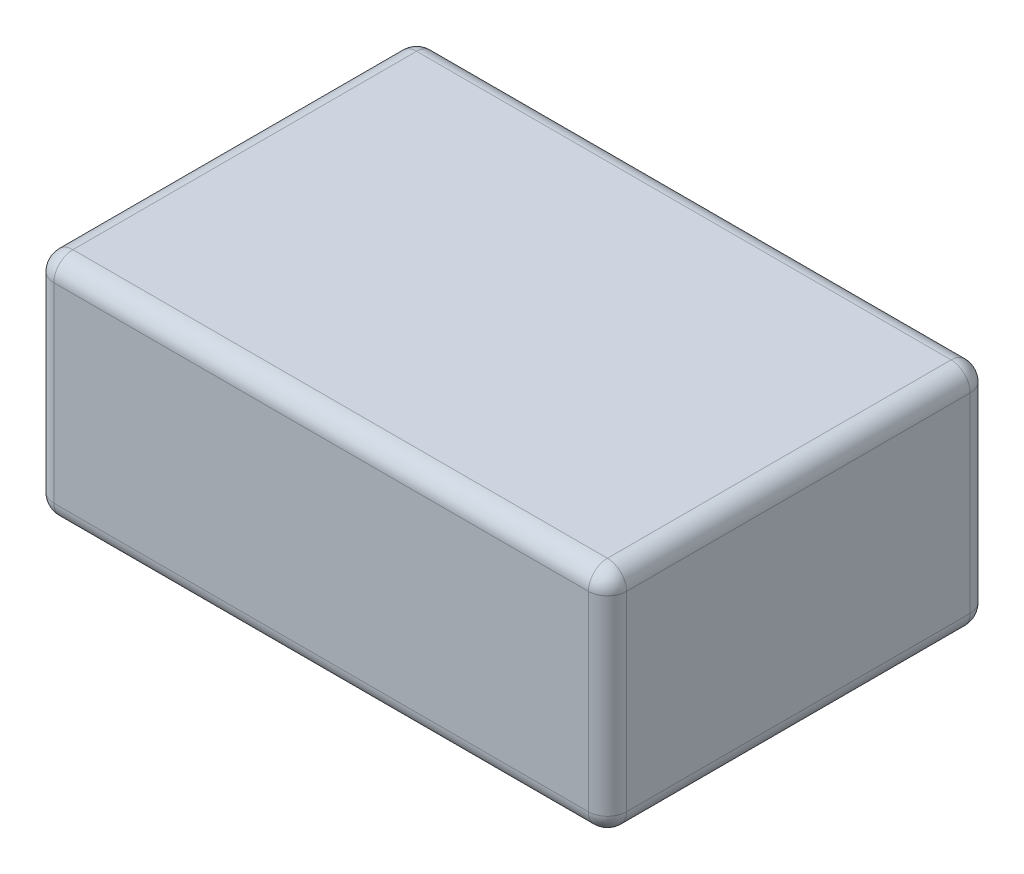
ISO-10303-21;
HEADER;
FILE_DESCRIPTION(('STEP AP214'),'2;1');
FILE_NAME('part.step','',(''),(''),'','','');
FILE_SCHEMA(('AUTOMOTIVE_DESIGN { 1 0 10303 214 1 1 1 1 }'));
ENDSEC;
DATA;
#1=APPLICATION_CONTEXT('core data for automotive mechanical design processes');
#2=APPLICATION_PROTOCOL_DEFINITION('international standard','automotive_design',2000,#1);
#3=PRODUCT_CONTEXT('',#1,'mechanical');
#4=PRODUCT('Part','Part','',(#3));
#5=PRODUCT_RELATED_PRODUCT_CATEGORY('part','',(#4));
#6=PRODUCT_DEFINITION_FORMATION('','',#4);
#7=PRODUCT_DEFINITION_CONTEXT('part definition',#1,'design');
#8=PRODUCT_DEFINITION('design','',#6,#7);
#9=PRODUCT_DEFINITION_SHAPE('','',#8);
#10=(LENGTH_UNIT() NAMED_UNIT(*) SI_UNIT(.MILLI.,.METRE.));
#11=(NAMED_UNIT(*) PLANE_ANGLE_UNIT() SI_UNIT($,.RADIAN.));
#12=(NAMED_UNIT(*) SI_UNIT($,.STERADIAN.) SOLID_ANGLE_UNIT());
#13=UNCERTAINTY_MEASURE_WITH_UNIT(LENGTH_MEASURE(1.E-05),#10,'distance_accuracy_value','');
#14=(GEOMETRIC_REPRESENTATION_CONTEXT(3) GLOBAL_UNCERTAINTY_ASSIGNED_CONTEXT((#13)) GLOBAL_UNIT_ASSIGNED_CONTEXT((#10,
#11,#12)) REPRESENTATION_CONTEXT('',''));
#15=CARTESIAN_POINT('',(0.,0.,0.));
#16=DIRECTION('',(0.,0.,1.));
#17=DIRECTION('',(1.,0.,0.));
#18=AXIS2_PLACEMENT_3D('',#15,#16,#17);
#19=CARTESIAN_POINT('',(75.,60.,-50.));
#20=DIRECTION('',(-1.,0.,0.));
#21=DIRECTION('',(0.,0.,1.));
#22=AXIS2_PLACEMENT_3D('',#19,#20,#21);
#23=PLANE('',#22);
#24=DIRECTION('',(0.,-1.,0.));
#25=VECTOR('',#24,1.);
#26=CARTESIAN_POINT('',(75.,60.,45.));
#27=LINE('',#26,#25);
#28=CARTESIAN_POINT('',(75.,55.,45.));
#29=VERTEX_POINT('',#28);
#30=CARTESIAN_POINT('',(75.,5.,45.));
#31=VERTEX_POINT('',#30);
#32=EDGE_CURVE('E151',#29,#31,#27,.T.);
#33=ORIENTED_EDGE('',*,*,#32,.T.);
#34=DIRECTION('',(0.,0.,-1.));
#35=VECTOR('',#34,1.);
#36=CARTESIAN_POINT('',(75.,5.,-50.));
#37=LINE('',#36,#35);
#38=CARTESIAN_POINT('',(75.,5.,-45.));
#39=VERTEX_POINT('',#38);
#40=EDGE_CURVE('E274',#31,#39,#37,.T.);
#41=ORIENTED_EDGE('',*,*,#40,.T.);
#42=DIRECTION('',(0.,-1.,0.));
#43=VECTOR('',#42,1.);
#44=CARTESIAN_POINT('',(75.,60.,-45.));
#45=LINE('',#44,#43);
#46=CARTESIAN_POINT('',(75.,55.,-45.));
#47=VERTEX_POINT('',#46);
#48=EDGE_CURVE('E272',#39,#47,#45,.F.);
#49=ORIENTED_EDGE('',*,*,#48,.T.);
#50=DIRECTION('',(0.,0.,-1.));
#51=VECTOR('',#50,1.);
#52=CARTESIAN_POINT('',(75.,55.,50.));
#53=LINE('',#52,#51);
#54=EDGE_CURVE('E265',#47,#29,#53,.F.);
#55=ORIENTED_EDGE('',*,*,#54,.T.);
#56=EDGE_LOOP('',(#33,#41,#49,#55));
#57=FACE_BOUND('',#56,.T.);
#58=ADVANCED_FACE('F32',(#57),#23,.F.);
#59=CARTESIAN_POINT('',(-75.,60.,-50.));
#60=DIRECTION('',(0.,0.,1.));
#61=DIRECTION('',(1.,0.,0.));
#62=AXIS2_PLACEMENT_3D('',#59,#60,#61);
#63=PLANE('',#62);
#64=DIRECTION('',(0.,-1.,0.));
#65=VECTOR('',#64,1.);
#66=CARTESIAN_POINT('',(70.,60.,-50.));
#67=LINE('',#66,#65);
#68=CARTESIAN_POINT('',(70.,55.,-50.));
#69=VERTEX_POINT('',#68);
#70=CARTESIAN_POINT('',(70.,5.,-50.));
#71=VERTEX_POINT('',#70);
#72=EDGE_CURVE('E279',#69,#71,#67,.T.);
#73=ORIENTED_EDGE('',*,*,#72,.T.);
#74=DIRECTION('',(-1.,0.,0.));
#75=VECTOR('',#74,1.);
#76=CARTESIAN_POINT('',(-75.,5.,-50.));
#77=LINE('',#76,#75);
#78=CARTESIAN_POINT('',(-70.,5.,-50.));
#79=VERTEX_POINT('',#78);
#80=EDGE_CURVE('E282',#71,#79,#77,.T.);
#81=ORIENTED_EDGE('',*,*,#80,.T.);
#82=DIRECTION('',(0.,-1.,0.));
#83=VECTOR('',#82,1.);
#84=CARTESIAN_POINT('',(-70.,60.,-50.));
#85=LINE('',#84,#83);
#86=CARTESIAN_POINT('',(-70.,55.,-50.));
#87=VERTEX_POINT('',#86);
#88=EDGE_CURVE('E210',#79,#87,#85,.F.);
#89=ORIENTED_EDGE('',*,*,#88,.T.);
#90=DIRECTION('',(-1.,0.,0.));
#91=VECTOR('',#90,1.);
#92=CARTESIAN_POINT('',(75.,55.,-50.));
#93=LINE('',#92,#91);
#94=EDGE_CURVE('E277',#87,#69,#93,.F.);
#95=ORIENTED_EDGE('',*,*,#94,.T.);
#96=EDGE_LOOP('',(#73,#81,#89,#95));
#97=FACE_BOUND('',#96,.T.);
#98=ADVANCED_FACE('F300',(#97),#63,.F.);
#99=CARTESIAN_POINT('',(-75.,60.,-50.));
#100=DIRECTION('',(1.,0.,0.));
#101=DIRECTION('',(0.,0.,-1.));
#102=AXIS2_PLACEMENT_3D('',#99,#100,#101);
#103=PLANE('',#102);
#104=CARTESIAN_POINT('',(-75.,42.5,-12.5));
#105=DIRECTION('',(-1.,0.,0.));
#106=DIRECTION('',(0.,0.,1.));
#107=AXIS2_PLACEMENT_3D('',#104,#105,#106);
#108=CIRCLE('',#107,3.);
#109=CARTESIAN_POINT('',(-75.,42.5,-9.50000000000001));
#110=VERTEX_POINT('',#109);
#111=EDGE_CURVE('E731',#110,#110,#108,.T.);
#112=ORIENTED_EDGE('',*,*,#111,.F.);
#113=EDGE_LOOP('',(#112));
#114=FACE_BOUND('',#113,.T.);
#115=CARTESIAN_POINT('',(-75.,42.5,12.5));
#116=DIRECTION('',(-1.,0.,0.));
#117=DIRECTION('',(0.,0.,1.));
#118=AXIS2_PLACEMENT_3D('',#115,#116,#117);
#119=CIRCLE('',#118,3.);
#120=CARTESIAN_POINT('',(-75.,42.5,15.5));
#121=VERTEX_POINT('',#120);
#122=EDGE_CURVE('E735',#121,#121,#119,.T.);
#123=ORIENTED_EDGE('',*,*,#122,.F.);
#124=EDGE_LOOP('',(#123));
#125=FACE_BOUND('',#124,.T.);
#126=CARTESIAN_POINT('',(-75.,42.5,37.5));
#127=DIRECTION('',(-1.,0.,0.));
#128=DIRECTION('',(0.,0.,1.));
#129=AXIS2_PLACEMENT_3D('',#126,#127,#128);
#130=CIRCLE('',#129,2.);
#131=CARTESIAN_POINT('',(-75.,42.5,39.5));
#132=VERTEX_POINT('',#131);
#133=EDGE_CURVE('E739',#132,#132,#130,.T.);
#134=ORIENTED_EDGE('',*,*,#133,.F.);
#135=EDGE_LOOP('',(#134));
#136=FACE_BOUND('',#135,.T.);
#137=CARTESIAN_POINT('',(-75.,17.5,37.5));
#138=DIRECTION('',(-1.,0.,0.));
#139=DIRECTION('',(0.,0.,1.));
#140=AXIS2_PLACEMENT_3D('',#137,#138,#139);
#141=CIRCLE('',#140,3.);
#142=CARTESIAN_POINT('',(-75.,17.5,40.5));
#143=VERTEX_POINT('',#142);
#144=EDGE_CURVE('E743',#143,#143,#141,.T.);
#145=ORIENTED_EDGE('',*,*,#144,.F.);
#146=EDGE_LOOP('',(#145));
#147=FACE_BOUND('',#146,.T.);
#148=CARTESIAN_POINT('',(-75.,17.5,-12.5));
#149=DIRECTION('',(-1.,0.,0.));
#150=DIRECTION('',(0.,0.,1.));
#151=AXIS2_PLACEMENT_3D('',#148,#149,#150);
#152=CIRCLE('',#151,3.);
#153=CARTESIAN_POINT('',(-75.,17.5,-9.50000000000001));
#154=VERTEX_POINT('',#153);
#155=EDGE_CURVE('E747',#154,#154,#152,.T.);
#156=ORIENTED_EDGE('',*,*,#155,.F.);
#157=EDGE_LOOP('',(#156));
#158=FACE_BOUND('',#157,.T.);
#159=CARTESIAN_POINT('',(-75.,17.5,-37.5));
#160=DIRECTION('',(-1.,0.,0.));
#161=DIRECTION('',(0.,0.,1.));
#162=AXIS2_PLACEMENT_3D('',#159,#160,#161);
#163=CIRCLE('',#162,3.);
#164=CARTESIAN_POINT('',(-75.,17.5,-34.5));
#165=VERTEX_POINT('',#164);
#166=EDGE_CURVE('E751',#165,#165,#163,.T.);
#167=ORIENTED_EDGE('',*,*,#166,.F.);
#168=EDGE_LOOP('',(#167));
#169=FACE_BOUND('',#168,.T.);
#170=CARTESIAN_POINT('',(-75.,17.5,12.5));
#171=DIRECTION('',(-1.,0.,0.));
#172=DIRECTION('',(0.,0.,1.));
#173=AXIS2_PLACEMENT_3D('',#170,#171,#172);
#174=CIRCLE('',#173,3.);
#175=CARTESIAN_POINT('',(-75.,17.5,15.5));
#176=VERTEX_POINT('',#175);
#177=EDGE_CURVE('E755',#176,#176,#174,.T.);
#178=ORIENTED_EDGE('',*,*,#177,.F.);
#179=EDGE_LOOP('',(#178));
#180=FACE_BOUND('',#179,.T.);
#181=CARTESIAN_POINT('',(-75.,42.5,-37.5));
#182=DIRECTION('',(-1.,0.,0.));
#183=DIRECTION('',(0.,0.,1.));
#184=AXIS2_PLACEMENT_3D('',#181,#182,#183);
#185=CIRCLE('',#184,3.);
#186=CARTESIAN_POINT('',(-75.,42.5,-34.5));
#187=VERTEX_POINT('',#186);
#188=EDGE_CURVE('E758',#187,#187,#185,.T.);
#189=ORIENTED_EDGE('',*,*,#188,.F.);
#190=EDGE_LOOP('',(#189));
#191=FACE_BOUND('',#190,.T.);
#192=DIRECTION('',(0.,-1.,0.));
#193=VECTOR('',#192,1.);
#194=CARTESIAN_POINT('',(-75.,60.,-45.));
#195=LINE('',#194,#193);
#196=CARTESIAN_POINT('',(-75.,55.,-45.));
#197=VERTEX_POINT('',#196);
#198=CARTESIAN_POINT('',(-75.,5.,-45.));
#199=VERTEX_POINT('',#198);
#200=EDGE_CURVE('E212',#197,#199,#195,.T.);
#201=ORIENTED_EDGE('',*,*,#200,.T.);
#202=DIRECTION('',(0.,0.,1.));
#203=VECTOR('',#202,1.);
#204=CARTESIAN_POINT('',(-75.,5.,-50.));
#205=LINE('',#204,#203);
#206=CARTESIAN_POINT('',(-75.,5.,45.));
#207=VERTEX_POINT('',#206);
#208=EDGE_CURVE('E216',#199,#207,#205,.T.);
#209=ORIENTED_EDGE('',*,*,#208,.T.);
#210=DIRECTION('',(0.,-1.,0.));
#211=VECTOR('',#210,1.);
#212=CARTESIAN_POINT('',(-75.,60.,45.));
#213=LINE('',#212,#211);
#214=CARTESIAN_POINT('',(-75.,55.,45.));
#215=VERTEX_POINT('',#214);
#216=EDGE_CURVE('E217',#207,#215,#213,.F.);
#217=ORIENTED_EDGE('',*,*,#216,.T.);
#218=DIRECTION('',(0.,0.,1.));
#219=VECTOR('',#218,1.);
#220=CARTESIAN_POINT('',(-75.,55.,-50.));
#221=LINE('',#220,#219);
#222=EDGE_CURVE('E221',#215,#197,#221,.F.);
#223=ORIENTED_EDGE('',*,*,#222,.T.);
#224=EDGE_LOOP('',(#201,#209,#217,#223));
#225=FACE_BOUND('',#224,.T.);
#226=ADVANCED_FACE('F284',(#114,#125,#136,#147,#158,#169,#180,#191,#225),#103,.F.);
#227=CARTESIAN_POINT('',(-75.,60.,50.));
#228=DIRECTION('',(0.,0.,-1.));
#229=DIRECTION('',(-1.,0.,0.));
#230=AXIS2_PLACEMENT_3D('',#227,#228,#229);
#231=PLANE('',#230);
#232=DIRECTION('',(0.,-1.,0.));
#233=VECTOR('',#232,1.);
#234=CARTESIAN_POINT('',(-70.,60.,50.));
#235=LINE('',#234,#233);
#236=CARTESIAN_POINT('',(-70.,55.,50.));
#237=VERTEX_POINT('',#236);
#238=CARTESIAN_POINT('',(-70.,5.,50.));
#239=VERTEX_POINT('',#238);
#240=EDGE_CURVE('E130',#237,#239,#235,.T.);
#241=ORIENTED_EDGE('',*,*,#240,.T.);
#242=DIRECTION('',(1.,0.,0.));
#243=VECTOR('',#242,1.);
#244=CARTESIAN_POINT('',(-75.,5.,50.));
#245=LINE('',#244,#243);
#246=CARTESIAN_POINT('',(70.,5.,50.));
#247=VERTEX_POINT('',#246);
#248=EDGE_CURVE('E126',#239,#247,#245,.T.);
#249=ORIENTED_EDGE('',*,*,#248,.T.);
#250=DIRECTION('',(0.,-1.,0.));
#251=VECTOR('',#250,1.);
#252=CARTESIAN_POINT('',(70.,60.,50.));
#253=LINE('',#252,#251);
#254=CARTESIAN_POINT('',(70.,55.,50.));
#255=VERTEX_POINT('',#254);
#256=EDGE_CURVE('E120',#247,#255,#253,.F.);
#257=ORIENTED_EDGE('',*,*,#256,.T.);
#258=DIRECTION('',(1.,0.,0.));
#259=VECTOR('',#258,1.);
#260=CARTESIAN_POINT('',(-75.,55.,50.));
#261=LINE('',#260,#259);
#262=EDGE_CURVE('E123',#255,#237,#261,.F.);
#263=ORIENTED_EDGE('',*,*,#262,.T.);
#264=EDGE_LOOP('',(#241,#249,#257,#263));
#265=FACE_BOUND('',#264,.T.);
#266=ADVANCED_FACE('F122',(#265),#231,.F.);
#267=CARTESIAN_POINT('',(0.,60.,0.));
#268=DIRECTION('',(0.,1.,0.));
#269=DIRECTION('',(0.,0.,1.));
#270=AXIS2_PLACEMENT_3D('',#267,#268,#269);
#271=PLANE('',#270);
#272=DIRECTION('',(0.,0.,-1.));
#273=VECTOR('',#272,1.);
#274=CARTESIAN_POINT('',(70.,60.,-50.));
#275=LINE('',#274,#273);
#276=CARTESIAN_POINT('',(70.,60.,45.));
#277=VERTEX_POINT('',#276);
#278=CARTESIAN_POINT('',(70.,60.,-45.));
#279=VERTEX_POINT('',#278);
#280=EDGE_CURVE('E52',#277,#279,#275,.T.);
#281=ORIENTED_EDGE('',*,*,#280,.T.);
#282=DIRECTION('',(-1.,0.,0.));
#283=VECTOR('',#282,1.);
#284=CARTESIAN_POINT('',(-75.,60.,-45.));
#285=LINE('',#284,#283);
#286=CARTESIAN_POINT('',(-70.,60.,-45.));
#287=VERTEX_POINT('',#286);
#288=EDGE_CURVE('E11',#279,#287,#285,.T.);
#289=ORIENTED_EDGE('',*,*,#288,.T.);
#290=DIRECTION('',(0.,0.,1.));
#291=VECTOR('',#290,1.);
#292=CARTESIAN_POINT('',(-70.,60.,50.));
#293=LINE('',#292,#291);
#294=CARTESIAN_POINT('',(-70.,60.,45.));
#295=VERTEX_POINT('',#294);
#296=EDGE_CURVE('E41',#287,#295,#293,.T.);
#297=ORIENTED_EDGE('',*,*,#296,.T.);
#298=DIRECTION('',(1.,0.,0.));
#299=VECTOR('',#298,1.);
#300=CARTESIAN_POINT('',(75.,60.,45.));
#301=LINE('',#300,#299);
#302=EDGE_CURVE('E219',#295,#277,#301,.T.);
#303=ORIENTED_EDGE('',*,*,#302,.T.);
#304=EDGE_LOOP('',(#281,#289,#297,#303));
#305=FACE_BOUND('',#304,.T.);
#306=ADVANCED_FACE('F288',(#305),#271,.T.);
#307=CARTESIAN_POINT('',(0.,0.,0.));
#308=DIRECTION('',(0.,1.,0.));
#309=DIRECTION('',(0.,0.,1.));
#310=AXIS2_PLACEMENT_3D('',#307,#308,#309);
#311=PLANE('',#310);
#312=CARTESIAN_POINT('',(-25.,0.,0.));
#313=DIRECTION('',(0.,-1.,0.));
#314=DIRECTION('',(0.,0.,-1.));
#315=AXIS2_PLACEMENT_3D('',#312,#313,#314);
#316=CIRCLE('',#315,3.);
#317=CARTESIAN_POINT('',(-25.,0.,-3.));
#318=VERTEX_POINT('',#317);
#319=EDGE_CURVE('E772',#318,#318,#316,.T.);
#320=ORIENTED_EDGE('',*,*,#319,.F.);
#321=EDGE_LOOP('',(#320));
#322=FACE_BOUND('',#321,.T.);
#323=CARTESIAN_POINT('',(25.,0.,0.));
#324=DIRECTION('',(0.,-1.,0.));
#325=DIRECTION('',(0.,0.,-1.));
#326=AXIS2_PLACEMENT_3D('',#323,#324,#325);
#327=CIRCLE('',#326,3.);
#328=CARTESIAN_POINT('',(25.,0.,-3.));
#329=VERTEX_POINT('',#328);
#330=EDGE_CURVE('E764',#329,#329,#327,.T.);
#331=ORIENTED_EDGE('',*,*,#330,.F.);
#332=EDGE_LOOP('',(#331));
#333=FACE_BOUND('',#332,.T.);
#334=DIRECTION('',(0.,0.,-1.));
#335=VECTOR('',#334,1.);
#336=CARTESIAN_POINT('',(70.,0.,0.));
#337=LINE('',#336,#335);
#338=CARTESIAN_POINT('',(70.,0.,-45.));
#339=VERTEX_POINT('',#338);
#340=CARTESIAN_POINT('',(70.,0.,45.));
#341=VERTEX_POINT('',#340);
#342=EDGE_CURVE('E261',#339,#341,#337,.F.);
#343=ORIENTED_EDGE('',*,*,#342,.T.);
#344=DIRECTION('',(1.,0.,0.));
#345=VECTOR('',#344,1.);
#346=CARTESIAN_POINT('',(0.,0.,45.));
#347=LINE('',#346,#345);
#348=CARTESIAN_POINT('',(-70.,0.,45.));
#349=VERTEX_POINT('',#348);
#350=EDGE_CURVE('E258',#341,#349,#347,.F.);
#351=ORIENTED_EDGE('',*,*,#350,.T.);
#352=DIRECTION('',(0.,0.,1.));
#353=VECTOR('',#352,1.);
#354=CARTESIAN_POINT('',(-70.,0.,0.));
#355=LINE('',#354,#353);
#356=CARTESIAN_POINT('',(-70.,0.,-45.));
#357=VERTEX_POINT('',#356);
#358=EDGE_CURVE('E250',#349,#357,#355,.F.);
#359=ORIENTED_EDGE('',*,*,#358,.T.);
#360=DIRECTION('',(-1.,0.,0.));
#361=VECTOR('',#360,1.);
#362=CARTESIAN_POINT('',(0.,0.,-45.));
#363=LINE('',#362,#361);
#364=EDGE_CURVE('E255',#357,#339,#363,.F.);
#365=ORIENTED_EDGE('',*,*,#364,.T.);
#366=EDGE_LOOP('',(#343,#351,#359,#365));
#367=FACE_BOUND('',#366,.T.);
#368=ADVANCED_FACE('F259',(#322,#333,#367),#311,.F.);
#369=CARTESIAN_POINT('',(0.,55.,-45.));
#370=DIRECTION('',(1.,0.,0.));
#371=DIRECTION('',(0.,0.,-1.));
#372=AXIS2_PLACEMENT_3D('',#369,#370,#371);
#373=CYLINDRICAL_SURFACE('',#372,5.);
#374=CARTESIAN_POINT('',(-70.,55.,-45.));
#375=DIRECTION('',(-1.,0.,0.));
#376=DIRECTION('',(0.,0.,1.));
#377=AXIS2_PLACEMENT_3D('',#374,#375,#376);
#378=CIRCLE('',#377,5.);
#379=EDGE_CURVE('E36',#287,#87,#378,.T.);
#380=ORIENTED_EDGE('',*,*,#379,.F.);
#381=ORIENTED_EDGE('',*,*,#288,.F.);
#382=CARTESIAN_POINT('',(70.,55.,-45.));
#383=DIRECTION('',(1.,0.,0.));
#384=DIRECTION('',(0.,0.,-1.));
#385=AXIS2_PLACEMENT_3D('',#382,#383,#384);
#386=CIRCLE('',#385,5.);
#387=EDGE_CURVE('E191',#69,#279,#386,.T.);
#388=ORIENTED_EDGE('',*,*,#387,.F.);
#389=ORIENTED_EDGE('',*,*,#94,.F.);
#390=EDGE_LOOP('',(#380,#381,#388,#389));
#391=FACE_BOUND('',#390,.T.);
#392=ADVANCED_FACE('F34',(#391),#373,.T.);
#393=CARTESIAN_POINT('',(-70.,55.,-45.));
#394=DIRECTION('',(0.,0.,1.));
#395=DIRECTION('',(1.,0.,0.));
#396=AXIS2_PLACEMENT_3D('',#393,#394,#395);
#397=SPHERICAL_SURFACE('',#396,5.);
#398=CARTESIAN_POINT('',(-70.,55.,-45.));
#399=DIRECTION('',(0.,0.,-1.));
#400=DIRECTION('',(-1.,0.,0.));
#401=AXIS2_PLACEMENT_3D('',#398,#399,#400);
#402=CIRCLE('',#401,5.);
#403=EDGE_CURVE('E186',#287,#197,#402,.F.);
#404=ORIENTED_EDGE('',*,*,#403,.F.);
#405=ORIENTED_EDGE('',*,*,#379,.T.);
#406=CARTESIAN_POINT('',(-70.,55.,-45.));
#407=DIRECTION('',(0.,1.,0.));
#408=DIRECTION('',(0.,0.,1.));
#409=AXIS2_PLACEMENT_3D('',#406,#407,#408);
#410=CIRCLE('',#409,5.);
#411=EDGE_CURVE('E189',#197,#87,#410,.F.);
#412=ORIENTED_EDGE('',*,*,#411,.F.);
#413=EDGE_LOOP('',(#404,#405,#412));
#414=FACE_BOUND('',#413,.T.);
#415=ADVANCED_FACE('F201',(#414),#397,.T.);
#416=CARTESIAN_POINT('',(70.,55.,-45.));
#417=DIRECTION('',(0.,0.,1.));
#418=DIRECTION('',(1.,0.,0.));
#419=AXIS2_PLACEMENT_3D('',#416,#417,#418);
#420=SPHERICAL_SURFACE('',#419,5.);
#421=CARTESIAN_POINT('',(70.,55.,-45.));
#422=DIRECTION('',(0.,1.,0.));
#423=DIRECTION('',(0.,0.,1.));
#424=AXIS2_PLACEMENT_3D('',#421,#422,#423);
#425=CIRCLE('',#424,5.);
#426=EDGE_CURVE('E180',#69,#47,#425,.F.);
#427=ORIENTED_EDGE('',*,*,#426,.F.);
#428=ORIENTED_EDGE('',*,*,#387,.T.);
#429=CARTESIAN_POINT('',(70.,55.,-45.));
#430=DIRECTION('',(0.,0.,-1.));
#431=DIRECTION('',(-1.,0.,0.));
#432=AXIS2_PLACEMENT_3D('',#429,#430,#431);
#433=CIRCLE('',#432,5.);
#434=EDGE_CURVE('E183',#47,#279,#433,.F.);
#435=ORIENTED_EDGE('',*,*,#434,.F.);
#436=EDGE_LOOP('',(#427,#428,#435));
#437=FACE_BOUND('',#436,.T.);
#438=ADVANCED_FACE('F292',(#437),#420,.T.);
#439=CARTESIAN_POINT('',(-70.,60.,-45.));
#440=DIRECTION('',(0.,-1.,0.));
#441=DIRECTION('',(0.,0.,-1.));
#442=AXIS2_PLACEMENT_3D('',#439,#440,#441);
#443=CYLINDRICAL_SURFACE('',#442,5.);
#444=ORIENTED_EDGE('',*,*,#411,.T.);
#445=ORIENTED_EDGE('',*,*,#88,.F.);
#446=CARTESIAN_POINT('',(-70.,5.,-45.));
#447=DIRECTION('',(0.,-1.,0.));
#448=DIRECTION('',(0.,0.,-1.));
#449=AXIS2_PLACEMENT_3D('',#446,#447,#448);
#450=CIRCLE('',#449,5.);
#451=EDGE_CURVE('E175',#199,#79,#450,.T.);
#452=ORIENTED_EDGE('',*,*,#451,.F.);
#453=ORIENTED_EDGE('',*,*,#200,.F.);
#454=EDGE_LOOP('',(#444,#445,#452,#453));
#455=FACE_BOUND('',#454,.T.);
#456=ADVANCED_FACE('F208',(#455),#443,.T.);
#457=CARTESIAN_POINT('',(-70.,55.,0.));
#458=DIRECTION('',(0.,0.,-1.));
#459=DIRECTION('',(-1.,0.,0.));
#460=AXIS2_PLACEMENT_3D('',#457,#458,#459);
#461=CYLINDRICAL_SURFACE('',#460,5.);
#462=ORIENTED_EDGE('',*,*,#403,.T.);
#463=ORIENTED_EDGE('',*,*,#222,.F.);
#464=CARTESIAN_POINT('',(-70.,55.,45.));
#465=DIRECTION('',(0.,0.,1.));
#466=DIRECTION('',(1.,0.,0.));
#467=AXIS2_PLACEMENT_3D('',#464,#465,#466);
#468=CIRCLE('',#467,5.);
#469=EDGE_CURVE('E172',#295,#215,#468,.T.);
#470=ORIENTED_EDGE('',*,*,#469,.F.);
#471=ORIENTED_EDGE('',*,*,#296,.F.);
#472=EDGE_LOOP('',(#462,#463,#470,#471));
#473=FACE_BOUND('',#472,.T.);
#474=ADVANCED_FACE('F287',(#473),#461,.T.);
#475=CARTESIAN_POINT('',(0.,55.,45.));
#476=DIRECTION('',(-1.,0.,0.));
#477=DIRECTION('',(0.,0.,1.));
#478=AXIS2_PLACEMENT_3D('',#475,#476,#477);
#479=CYLINDRICAL_SURFACE('',#478,5.);
#480=CARTESIAN_POINT('',(70.,55.,45.));
#481=DIRECTION('',(1.,0.,0.));
#482=DIRECTION('',(0.,0.,-1.));
#483=AXIS2_PLACEMENT_3D('',#480,#481,#482);
#484=CIRCLE('',#483,5.);
#485=EDGE_CURVE('E137',#277,#255,#484,.T.);
#486=ORIENTED_EDGE('',*,*,#485,.F.);
#487=ORIENTED_EDGE('',*,*,#302,.F.);
#488=CARTESIAN_POINT('',(-70.,55.,45.));
#489=DIRECTION('',(-1.,0.,0.));
#490=DIRECTION('',(0.,0.,1.));
#491=AXIS2_PLACEMENT_3D('',#488,#489,#490);
#492=CIRCLE('',#491,5.);
#493=EDGE_CURVE('E139',#237,#295,#492,.T.);
#494=ORIENTED_EDGE('',*,*,#493,.F.);
#495=ORIENTED_EDGE('',*,*,#262,.F.);
#496=EDGE_LOOP('',(#486,#487,#494,#495));
#497=FACE_BOUND('',#496,.T.);
#498=ADVANCED_FACE('F135',(#497),#479,.T.);
#499=CARTESIAN_POINT('',(70.,55.,0.));
#500=DIRECTION('',(0.,0.,1.));
#501=DIRECTION('',(1.,0.,0.));
#502=AXIS2_PLACEMENT_3D('',#499,#500,#501);
#503=CYLINDRICAL_SURFACE('',#502,5.);
#504=ORIENTED_EDGE('',*,*,#434,.T.);
#505=ORIENTED_EDGE('',*,*,#280,.F.);
#506=CARTESIAN_POINT('',(70.,55.,45.));
#507=DIRECTION('',(0.,0.,1.));
#508=DIRECTION('',(0.,-1.,0.));
#509=AXIS2_PLACEMENT_3D('',#506,#507,#508);
#510=CIRCLE('',#509,5.);
#511=EDGE_CURVE('E148',#29,#277,#510,.T.);
#512=ORIENTED_EDGE('',*,*,#511,.F.);
#513=ORIENTED_EDGE('',*,*,#54,.F.);
#514=EDGE_LOOP('',(#504,#505,#512,#513));
#515=FACE_BOUND('',#514,.T.);
#516=ADVANCED_FACE('F290',(#515),#503,.T.);
#517=CARTESIAN_POINT('',(70.,60.,-45.));
#518=DIRECTION('',(0.,-1.,0.));
#519=DIRECTION('',(0.,0.,-1.));
#520=AXIS2_PLACEMENT_3D('',#517,#518,#519);
#521=CYLINDRICAL_SURFACE('',#520,5.);
#522=ORIENTED_EDGE('',*,*,#426,.T.);
#523=ORIENTED_EDGE('',*,*,#48,.F.);
#524=CARTESIAN_POINT('',(70.,5.,-45.));
#525=DIRECTION('',(0.,-1.,0.));
#526=DIRECTION('',(0.,0.,-1.));
#527=AXIS2_PLACEMENT_3D('',#524,#525,#526);
#528=CIRCLE('',#527,5.);
#529=EDGE_CURVE('E167',#71,#39,#528,.T.);
#530=ORIENTED_EDGE('',*,*,#529,.F.);
#531=ORIENTED_EDGE('',*,*,#72,.F.);
#532=EDGE_LOOP('',(#522,#523,#530,#531));
#533=FACE_BOUND('',#532,.T.);
#534=ADVANCED_FACE('F297',(#533),#521,.T.);
#535=CARTESIAN_POINT('',(-75.,5.,-45.));
#536=DIRECTION('',(-1.,0.,0.));
#537=DIRECTION('',(0.,0.,1.));
#538=AXIS2_PLACEMENT_3D('',#535,#536,#537);
#539=CYLINDRICAL_SURFACE('',#538,5.);
#540=CARTESIAN_POINT('',(-70.,5.,-45.));
#541=DIRECTION('',(-1.,0.,0.));
#542=DIRECTION('',(0.,0.,1.));
#543=AXIS2_PLACEMENT_3D('',#540,#541,#542);
#544=CIRCLE('',#543,5.);
#545=EDGE_CURVE('E177',#79,#357,#544,.T.);
#546=ORIENTED_EDGE('',*,*,#545,.F.);
#547=ORIENTED_EDGE('',*,*,#80,.F.);
#548=CARTESIAN_POINT('',(70.,5.,-45.));
#549=DIRECTION('',(1.,0.,0.));
#550=DIRECTION('',(0.,0.,-1.));
#551=AXIS2_PLACEMENT_3D('',#548,#549,#550);
#552=CIRCLE('',#551,5.);
#553=EDGE_CURVE('E164',#339,#71,#552,.T.);
#554=ORIENTED_EDGE('',*,*,#553,.F.);
#555=ORIENTED_EDGE('',*,*,#364,.F.);
#556=EDGE_LOOP('',(#546,#547,#554,#555));
#557=FACE_BOUND('',#556,.T.);
#558=ADVANCED_FACE('F304',(#557),#539,.T.);
#559=CARTESIAN_POINT('',(-70.,5.,-45.));
#560=DIRECTION('',(0.,0.,1.));
#561=DIRECTION('',(1.,0.,0.));
#562=AXIS2_PLACEMENT_3D('',#559,#560,#561);
#563=SPHERICAL_SURFACE('',#562,5.);
#564=ORIENTED_EDGE('',*,*,#451,.T.);
#565=ORIENTED_EDGE('',*,*,#545,.T.);
#566=CARTESIAN_POINT('',(-70.,5.,-45.));
#567=DIRECTION('',(0.,0.,-1.));
#568=DIRECTION('',(-1.,0.,0.));
#569=AXIS2_PLACEMENT_3D('',#566,#567,#568);
#570=CIRCLE('',#569,5.);
#571=EDGE_CURVE('E156',#199,#357,#570,.F.);
#572=ORIENTED_EDGE('',*,*,#571,.F.);
#573=EDGE_LOOP('',(#564,#565,#572));
#574=FACE_BOUND('',#573,.T.);
#575=ADVANCED_FACE('F307',(#574),#563,.T.);
#576=CARTESIAN_POINT('',(-70.,55.,45.));
#577=DIRECTION('',(0.,0.,1.));
#578=DIRECTION('',(1.,0.,0.));
#579=AXIS2_PLACEMENT_3D('',#576,#577,#578);
#580=SPHERICAL_SURFACE('',#579,5.);
#581=ORIENTED_EDGE('',*,*,#493,.T.);
#582=ORIENTED_EDGE('',*,*,#469,.T.);
#583=CARTESIAN_POINT('',(-70.,55.,45.));
#584=DIRECTION('',(0.,1.,0.));
#585=DIRECTION('',(0.,0.,1.));
#586=AXIS2_PLACEMENT_3D('',#583,#584,#585);
#587=CIRCLE('',#586,5.);
#588=EDGE_CURVE('E152',#237,#215,#587,.F.);
#589=ORIENTED_EDGE('',*,*,#588,.F.);
#590=EDGE_LOOP('',(#581,#582,#589));
#591=FACE_BOUND('',#590,.T.);
#592=ADVANCED_FACE('F309',(#591),#580,.T.);
#593=CARTESIAN_POINT('',(70.,55.,45.));
#594=DIRECTION('',(0.,0.,1.));
#595=DIRECTION('',(1.,0.,0.));
#596=AXIS2_PLACEMENT_3D('',#593,#594,#595);
#597=SPHERICAL_SURFACE('',#596,5.);
#598=ORIENTED_EDGE('',*,*,#511,.T.);
#599=ORIENTED_EDGE('',*,*,#485,.T.);
#600=CARTESIAN_POINT('',(70.,55.,45.));
#601=DIRECTION('',(0.,1.,0.));
#602=DIRECTION('',(0.,0.,1.));
#603=AXIS2_PLACEMENT_3D('',#600,#601,#602);
#604=CIRCLE('',#603,5.);
#605=EDGE_CURVE('E145',#29,#255,#604,.F.);
#606=ORIENTED_EDGE('',*,*,#605,.F.);
#607=EDGE_LOOP('',(#598,#599,#606));
#608=FACE_BOUND('',#607,.T.);
#609=ADVANCED_FACE('F144',(#608),#597,.T.);
#610=CARTESIAN_POINT('',(70.,5.,-45.));
#611=DIRECTION('',(0.,0.,1.));
#612=DIRECTION('',(1.,0.,0.));
#613=AXIS2_PLACEMENT_3D('',#610,#611,#612);
#614=SPHERICAL_SURFACE('',#613,5.);
#615=ORIENTED_EDGE('',*,*,#553,.T.);
#616=ORIENTED_EDGE('',*,*,#529,.T.);
#617=CARTESIAN_POINT('',(70.,5.,-45.));
#618=DIRECTION('',(0.,0.,-1.));
#619=DIRECTION('',(-1.,0.,0.));
#620=AXIS2_PLACEMENT_3D('',#617,#618,#619);
#621=CIRCLE('',#620,5.);
#622=EDGE_CURVE('E153',#339,#39,#621,.F.);
#623=ORIENTED_EDGE('',*,*,#622,.F.);
#624=EDGE_LOOP('',(#615,#616,#623));
#625=FACE_BOUND('',#624,.T.);
#626=ADVANCED_FACE('F349',(#625),#614,.T.);
#627=CARTESIAN_POINT('',(-70.,5.,-50.));
#628=DIRECTION('',(0.,0.,1.));
#629=DIRECTION('',(1.,0.,0.));
#630=AXIS2_PLACEMENT_3D('',#627,#628,#629);
#631=CYLINDRICAL_SURFACE('',#630,5.);
#632=ORIENTED_EDGE('',*,*,#571,.T.);
#633=ORIENTED_EDGE('',*,*,#358,.F.);
#634=CARTESIAN_POINT('',(-70.,5.,45.));
#635=DIRECTION('',(0.,0.,1.));
#636=DIRECTION('',(1.,0.,0.));
#637=AXIS2_PLACEMENT_3D('',#634,#635,#636);
#638=CIRCLE('',#637,5.);
#639=EDGE_CURVE('E158',#207,#349,#638,.T.);
#640=ORIENTED_EDGE('',*,*,#639,.F.);
#641=ORIENTED_EDGE('',*,*,#208,.F.);
#642=EDGE_LOOP('',(#632,#633,#640,#641));
#643=FACE_BOUND('',#642,.T.);
#644=ADVANCED_FACE('F252',(#643),#631,.T.);
#645=CARTESIAN_POINT('',(-70.,60.,45.));
#646=DIRECTION('',(0.,-1.,0.));
#647=DIRECTION('',(0.,0.,-1.));
#648=AXIS2_PLACEMENT_3D('',#645,#646,#647);
#649=CYLINDRICAL_SURFACE('',#648,5.);
#650=ORIENTED_EDGE('',*,*,#588,.T.);
#651=ORIENTED_EDGE('',*,*,#216,.F.);
#652=CARTESIAN_POINT('',(-70.,5.,45.));
#653=DIRECTION('',(0.,-1.,0.));
#654=DIRECTION('',(0.,0.,-1.));
#655=AXIS2_PLACEMENT_3D('',#652,#653,#654);
#656=CIRCLE('',#655,5.);
#657=EDGE_CURVE('E239',#239,#207,#656,.T.);
#658=ORIENTED_EDGE('',*,*,#657,.F.);
#659=ORIENTED_EDGE('',*,*,#240,.F.);
#660=EDGE_LOOP('',(#650,#651,#658,#659));
#661=FACE_BOUND('',#660,.T.);
#662=ADVANCED_FACE('F343',(#661),#649,.T.);
#663=CARTESIAN_POINT('',(70.,60.,45.));
#664=DIRECTION('',(0.,-1.,0.));
#665=DIRECTION('',(0.,0.,-1.));
#666=AXIS2_PLACEMENT_3D('',#663,#664,#665);
#667=CYLINDRICAL_SURFACE('',#666,5.);
#668=ORIENTED_EDGE('',*,*,#605,.T.);
#669=ORIENTED_EDGE('',*,*,#256,.F.);
#670=CARTESIAN_POINT('',(70.,5.,45.));
#671=DIRECTION('',(0.,-1.,0.));
#672=DIRECTION('',(0.,0.,-1.));
#673=AXIS2_PLACEMENT_3D('',#670,#671,#672);
#674=CIRCLE('',#673,5.);
#675=EDGE_CURVE('E236',#31,#247,#674,.T.);
#676=ORIENTED_EDGE('',*,*,#675,.F.);
#677=ORIENTED_EDGE('',*,*,#32,.F.);
#678=EDGE_LOOP('',(#668,#669,#676,#677));
#679=FACE_BOUND('',#678,.T.);
#680=ADVANCED_FACE('F150',(#679),#667,.T.);
#681=CARTESIAN_POINT('',(70.,5.,-50.));
#682=DIRECTION('',(0.,0.,-1.));
#683=DIRECTION('',(-1.,0.,0.));
#684=AXIS2_PLACEMENT_3D('',#681,#682,#683);
#685=CYLINDRICAL_SURFACE('',#684,5.);
#686=ORIENTED_EDGE('',*,*,#622,.T.);
#687=ORIENTED_EDGE('',*,*,#40,.F.);
#688=CARTESIAN_POINT('',(70.,5.,45.));
#689=DIRECTION('',(0.,0.,1.));
#690=DIRECTION('',(1.,0.,0.));
#691=AXIS2_PLACEMENT_3D('',#688,#689,#690);
#692=CIRCLE('',#691,5.);
#693=EDGE_CURVE('E233',#341,#31,#692,.T.);
#694=ORIENTED_EDGE('',*,*,#693,.F.);
#695=ORIENTED_EDGE('',*,*,#342,.F.);
#696=EDGE_LOOP('',(#686,#687,#694,#695));
#697=FACE_BOUND('',#696,.T.);
#698=ADVANCED_FACE('F337',(#697),#685,.T.);
#699=CARTESIAN_POINT('',(-70.,5.,45.));
#700=DIRECTION('',(0.,0.,1.));
#701=DIRECTION('',(1.,0.,0.));
#702=AXIS2_PLACEMENT_3D('',#699,#700,#701);
#703=SPHERICAL_SURFACE('',#702,5.);
#704=ORIENTED_EDGE('',*,*,#657,.T.);
#705=ORIENTED_EDGE('',*,*,#639,.T.);
#706=CARTESIAN_POINT('',(-70.,5.,45.));
#707=DIRECTION('',(-1.,0.,0.));
#708=DIRECTION('',(0.,0.,1.));
#709=AXIS2_PLACEMENT_3D('',#706,#707,#708);
#710=CIRCLE('',#709,5.);
#711=EDGE_CURVE('E230',#239,#349,#710,.F.);
#712=ORIENTED_EDGE('',*,*,#711,.F.);
#713=EDGE_LOOP('',(#704,#705,#712));
#714=FACE_BOUND('',#713,.T.);
#715=ADVANCED_FACE('F245',(#714),#703,.T.);
#716=CARTESIAN_POINT('',(70.,5.,45.));
#717=DIRECTION('',(0.,0.,1.));
#718=DIRECTION('',(1.,0.,0.));
#719=AXIS2_PLACEMENT_3D('',#716,#717,#718);
#720=SPHERICAL_SURFACE('',#719,5.);
#721=ORIENTED_EDGE('',*,*,#693,.T.);
#722=ORIENTED_EDGE('',*,*,#675,.T.);
#723=CARTESIAN_POINT('',(70.,5.,45.));
#724=DIRECTION('',(1.,0.,0.));
#725=DIRECTION('',(0.,0.,-1.));
#726=AXIS2_PLACEMENT_3D('',#723,#724,#725);
#727=CIRCLE('',#726,5.);
#728=EDGE_CURVE('E228',#341,#247,#727,.F.);
#729=ORIENTED_EDGE('',*,*,#728,.F.);
#730=EDGE_LOOP('',(#721,#722,#729));
#731=FACE_BOUND('',#730,.T.);
#732=ADVANCED_FACE('F331',(#731),#720,.T.);
#733=CARTESIAN_POINT('',(-75.,5.,45.));
#734=DIRECTION('',(1.,0.,0.));
#735=DIRECTION('',(0.,0.,-1.));
#736=AXIS2_PLACEMENT_3D('',#733,#734,#735);
#737=CYLINDRICAL_SURFACE('',#736,5.);
#738=ORIENTED_EDGE('',*,*,#711,.T.);
#739=ORIENTED_EDGE('',*,*,#350,.F.);
#740=ORIENTED_EDGE('',*,*,#728,.T.);
#741=ORIENTED_EDGE('',*,*,#248,.F.);
#742=EDGE_LOOP('',(#738,#739,#740,#741));
#743=FACE_BOUND('',#742,.T.);
#744=ADVANCED_FACE('F327',(#743),#737,.T.);
#745=CARTESIAN_POINT('',(25.,3.,0.));
#746=DIRECTION('',(0.,-1.,0.));
#747=DIRECTION('',(0.,0.,-1.));
#748=AXIS2_PLACEMENT_3D('',#745,#746,#747);
#749=CYLINDRICAL_SURFACE('',#748,3.);
#750=CARTESIAN_POINT('',(25.,3.,0.));
#751=DIRECTION('',(0.,-1.,0.));
#752=DIRECTION('',(0.,0.,-1.));
#753=AXIS2_PLACEMENT_3D('',#750,#751,#752);
#754=CIRCLE('',#753,3.);
#755=CARTESIAN_POINT('',(25.,3.,-3.));
#756=VERTEX_POINT('',#755);
#757=EDGE_CURVE('E775',#756,#756,#754,.T.);
#758=ORIENTED_EDGE('',*,*,#757,.F.);
#759=EDGE_LOOP('',(#758));
#760=FACE_BOUND('',#759,.T.);
#761=ORIENTED_EDGE('',*,*,#330,.T.);
#762=EDGE_LOOP('',(#761));
#763=FACE_BOUND('',#762,.T.);
#764=ADVANCED_FACE('F330',(#760,#763),#749,.F.);
#765=CARTESIAN_POINT('',(25.,3.,0.));
#766=DIRECTION('',(0.,-1.,0.));
#767=DIRECTION('',(0.,0.,-1.));
#768=AXIS2_PLACEMENT_3D('',#765,#766,#767);
#769=PLANE('',#768);
#770=ORIENTED_EDGE('',*,*,#757,.T.);
#771=EDGE_LOOP('',(#770));
#772=FACE_BOUND('',#771,.T.);
#773=ADVANCED_FACE('F397',(#772),#769,.T.);
#774=CARTESIAN_POINT('',(-25.,3.,0.));
#775=DIRECTION('',(0.,-1.,0.));
#776=DIRECTION('',(0.,0.,-1.));
#777=AXIS2_PLACEMENT_3D('',#774,#775,#776);
#778=CYLINDRICAL_SURFACE('',#777,3.);
#779=CARTESIAN_POINT('',(-25.,3.,0.));
#780=DIRECTION('',(0.,-1.,0.));
#781=DIRECTION('',(0.,0.,-1.));
#782=AXIS2_PLACEMENT_3D('',#779,#780,#781);
#783=CIRCLE('',#782,3.);
#784=CARTESIAN_POINT('',(-25.,3.,-3.));
#785=VERTEX_POINT('',#784);
#786=EDGE_CURVE('E231',#785,#785,#783,.T.);
#787=ORIENTED_EDGE('',*,*,#786,.F.);
#788=EDGE_LOOP('',(#787));
#789=FACE_BOUND('',#788,.T.);
#790=ORIENTED_EDGE('',*,*,#319,.T.);
#791=EDGE_LOOP('',(#790));
#792=FACE_BOUND('',#791,.T.);
#793=ADVANCED_FACE('F405',(#789,#792),#778,.F.);
#794=CARTESIAN_POINT('',(-25.,3.,0.));
#795=DIRECTION('',(0.,-1.,0.));
#796=DIRECTION('',(0.,0.,-1.));
#797=AXIS2_PLACEMENT_3D('',#794,#795,#796);
#798=PLANE('',#797);
#799=ORIENTED_EDGE('',*,*,#786,.T.);
#800=EDGE_LOOP('',(#799));
#801=FACE_BOUND('',#800,.T.);
#802=ADVANCED_FACE('F413',(#801),#798,.T.);
#803=CARTESIAN_POINT('',(-65.,42.5,-37.5));
#804=DIRECTION('',(-1.,0.,0.));
#805=DIRECTION('',(0.,0.,1.));
#806=AXIS2_PLACEMENT_3D('',#803,#804,#805);
#807=CYLINDRICAL_SURFACE('',#806,3.);
#808=CARTESIAN_POINT('',(-65.,42.5,-37.5));
#809=DIRECTION('',(-1.,0.,0.));
#810=DIRECTION('',(0.,0.,1.));
#811=AXIS2_PLACEMENT_3D('',#808,#809,#810);
#812=CIRCLE('',#811,3.);
#813=CARTESIAN_POINT('',(-65.,42.5,-34.5));
#814=VERTEX_POINT('',#813);
#815=EDGE_CURVE('E760',#814,#814,#812,.T.);
#816=ORIENTED_EDGE('',*,*,#815,.F.);
#817=EDGE_LOOP('',(#816));
#818=FACE_BOUND('',#817,.T.);
#819=ORIENTED_EDGE('',*,*,#188,.T.);
#820=EDGE_LOOP('',(#819));
#821=FACE_BOUND('',#820,.T.);
#822=ADVANCED_FACE('F421',(#818,#821),#807,.F.);
#823=CARTESIAN_POINT('',(-65.,42.5,-37.5));
#824=DIRECTION('',(-1.,0.,0.));
#825=DIRECTION('',(0.,0.,1.));
#826=AXIS2_PLACEMENT_3D('',#823,#824,#825);
#827=PLANE('',#826);
#828=ORIENTED_EDGE('',*,*,#815,.T.);
#829=EDGE_LOOP('',(#828));
#830=FACE_BOUND('',#829,.T.);
#831=ADVANCED_FACE('F430',(#830),#827,.T.);
#832=CARTESIAN_POINT('',(-65.,17.5,12.5));
#833=DIRECTION('',(-1.,0.,0.));
#834=DIRECTION('',(0.,0.,1.));
#835=AXIS2_PLACEMENT_3D('',#832,#833,#834);
#836=CYLINDRICAL_SURFACE('',#835,3.);
#837=CARTESIAN_POINT('',(-65.,17.5,12.5));
#838=DIRECTION('',(-1.,0.,0.));
#839=DIRECTION('',(0.,0.,1.));
#840=AXIS2_PLACEMENT_3D('',#837,#838,#839);
#841=CIRCLE('',#840,3.);
#842=CARTESIAN_POINT('',(-65.,17.5,15.5));
#843=VERTEX_POINT('',#842);
#844=EDGE_CURVE('E804',#843,#843,#841,.T.);
#845=ORIENTED_EDGE('',*,*,#844,.F.);
#846=EDGE_LOOP('',(#845));
#847=FACE_BOUND('',#846,.T.);
#848=ORIENTED_EDGE('',*,*,#177,.T.);
#849=EDGE_LOOP('',(#848));
#850=FACE_BOUND('',#849,.T.);
#851=ADVANCED_FACE('F438',(#847,#850),#836,.F.);
#852=CARTESIAN_POINT('',(-65.,17.5,12.5));
#853=DIRECTION('',(-1.,0.,0.));
#854=DIRECTION('',(0.,0.,1.));
#855=AXIS2_PLACEMENT_3D('',#852,#853,#854);
#856=PLANE('',#855);
#857=ORIENTED_EDGE('',*,*,#844,.T.);
#858=EDGE_LOOP('',(#857));
#859=FACE_BOUND('',#858,.T.);
#860=ADVANCED_FACE('F446',(#859),#856,.T.);
#861=CARTESIAN_POINT('',(-65.,17.5,-37.5));
#862=DIRECTION('',(-1.,0.,0.));
#863=DIRECTION('',(0.,0.,1.));
#864=AXIS2_PLACEMENT_3D('',#861,#862,#863);
#865=CYLINDRICAL_SURFACE('',#864,3.);
#866=CARTESIAN_POINT('',(-65.,17.5,-37.5));
#867=DIRECTION('',(-1.,0.,0.));
#868=DIRECTION('',(0.,0.,1.));
#869=AXIS2_PLACEMENT_3D('',#866,#867,#868);
#870=CIRCLE('',#869,3.);
#871=CARTESIAN_POINT('',(-65.,17.5,-34.5));
#872=VERTEX_POINT('',#871);
#873=EDGE_CURVE('E808',#872,#872,#870,.T.);
#874=ORIENTED_EDGE('',*,*,#873,.F.);
#875=EDGE_LOOP('',(#874));
#876=FACE_BOUND('',#875,.T.);
#877=ORIENTED_EDGE('',*,*,#166,.T.);
#878=EDGE_LOOP('',(#877));
#879=FACE_BOUND('',#878,.T.);
#880=ADVANCED_FACE('F454',(#876,#879),#865,.F.);
#881=CARTESIAN_POINT('',(-65.,17.5,-37.5));
#882=DIRECTION('',(-1.,0.,0.));
#883=DIRECTION('',(0.,0.,1.));
#884=AXIS2_PLACEMENT_3D('',#881,#882,#883);
#885=PLANE('',#884);
#886=ORIENTED_EDGE('',*,*,#873,.T.);
#887=EDGE_LOOP('',(#886));
#888=FACE_BOUND('',#887,.T.);
#889=ADVANCED_FACE('F462',(#888),#885,.T.);
#890=CARTESIAN_POINT('',(-65.,17.5,-12.5));
#891=DIRECTION('',(-1.,0.,0.));
#892=DIRECTION('',(0.,0.,1.));
#893=AXIS2_PLACEMENT_3D('',#890,#891,#892);
#894=CYLINDRICAL_SURFACE('',#893,3.);
#895=CARTESIAN_POINT('',(-65.,17.5,-12.5));
#896=DIRECTION('',(-1.,0.,0.));
#897=DIRECTION('',(0.,0.,1.));
#898=AXIS2_PLACEMENT_3D('',#895,#896,#897);
#899=CIRCLE('',#898,3.);
#900=CARTESIAN_POINT('',(-65.,17.5,-9.50000000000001));
#901=VERTEX_POINT('',#900);
#902=EDGE_CURVE('E791',#901,#901,#899,.T.);
#903=ORIENTED_EDGE('',*,*,#902,.F.);
#904=EDGE_LOOP('',(#903));
#905=FACE_BOUND('',#904,.T.);
#906=ORIENTED_EDGE('',*,*,#155,.T.);
#907=EDGE_LOOP('',(#906));
#908=FACE_BOUND('',#907,.T.);
#909=ADVANCED_FACE('F470',(#905,#908),#894,.F.);
#910=CARTESIAN_POINT('',(-65.,17.5,-12.5));
#911=DIRECTION('',(-1.,0.,0.));
#912=DIRECTION('',(0.,0.,1.));
#913=AXIS2_PLACEMENT_3D('',#910,#911,#912);
#914=PLANE('',#913);
#915=ORIENTED_EDGE('',*,*,#902,.T.);
#916=EDGE_LOOP('',(#915));
#917=FACE_BOUND('',#916,.T.);
#918=ADVANCED_FACE('F478',(#917),#914,.T.);
#919=CARTESIAN_POINT('',(-65.,17.5,37.5));
#920=DIRECTION('',(-1.,0.,0.));
#921=DIRECTION('',(0.,0.,1.));
#922=AXIS2_PLACEMENT_3D('',#919,#920,#921);
#923=CYLINDRICAL_SURFACE('',#922,3.);
#924=CARTESIAN_POINT('',(-65.,17.5,37.5));
#925=DIRECTION('',(-1.,0.,0.));
#926=DIRECTION('',(0.,0.,1.));
#927=AXIS2_PLACEMENT_3D('',#924,#925,#926);
#928=CIRCLE('',#927,3.);
#929=CARTESIAN_POINT('',(-65.,17.5,40.5));
#930=VERTEX_POINT('',#929);
#931=EDGE_CURVE('E790',#930,#930,#928,.T.);
#932=ORIENTED_EDGE('',*,*,#931,.F.);
#933=EDGE_LOOP('',(#932));
#934=FACE_BOUND('',#933,.T.);
#935=ORIENTED_EDGE('',*,*,#144,.T.);
#936=EDGE_LOOP('',(#935));
#937=FACE_BOUND('',#936,.T.);
#938=ADVANCED_FACE('F486',(#934,#937),#923,.F.);
#939=CARTESIAN_POINT('',(-65.,17.5,37.5));
#940=DIRECTION('',(-1.,0.,0.));
#941=DIRECTION('',(0.,0.,1.));
#942=AXIS2_PLACEMENT_3D('',#939,#940,#941);
#943=PLANE('',#942);
#944=ORIENTED_EDGE('',*,*,#931,.T.);
#945=EDGE_LOOP('',(#944));
#946=FACE_BOUND('',#945,.T.);
#947=ADVANCED_FACE('F494',(#946),#943,.T.);
#948=CARTESIAN_POINT('',(-65.,42.5,37.5));
#949=DIRECTION('',(-1.,0.,0.));
#950=DIRECTION('',(0.,0.,1.));
#951=AXIS2_PLACEMENT_3D('',#948,#949,#950);
#952=CYLINDRICAL_SURFACE('',#951,2.);
#953=CARTESIAN_POINT('',(-65.,42.5,37.5));
#954=DIRECTION('',(-1.,0.,0.));
#955=DIRECTION('',(0.,0.,1.));
#956=AXIS2_PLACEMENT_3D('',#953,#954,#955);
#957=CIRCLE('',#956,2.);
#958=CARTESIAN_POINT('',(-65.,42.5,39.5));
#959=VERTEX_POINT('',#958);
#960=EDGE_CURVE('E795',#959,#959,#957,.T.);
#961=ORIENTED_EDGE('',*,*,#960,.F.);
#962=EDGE_LOOP('',(#961));
#963=FACE_BOUND('',#962,.T.);
#964=ORIENTED_EDGE('',*,*,#133,.T.);
#965=EDGE_LOOP('',(#964));
#966=FACE_BOUND('',#965,.T.);
#967=ADVANCED_FACE('F502',(#963,#966),#952,.F.);
#968=CARTESIAN_POINT('',(-65.,42.5,37.5));
#969=DIRECTION('',(-1.,0.,0.));
#970=DIRECTION('',(0.,0.,1.));
#971=AXIS2_PLACEMENT_3D('',#968,#969,#970);
#972=PLANE('',#971);
#973=ORIENTED_EDGE('',*,*,#960,.T.);
#974=EDGE_LOOP('',(#973));
#975=FACE_BOUND('',#974,.T.);
#976=ADVANCED_FACE('F510',(#975),#972,.T.);
#977=CARTESIAN_POINT('',(-65.,42.5,12.5));
#978=DIRECTION('',(-1.,0.,0.));
#979=DIRECTION('',(0.,0.,1.));
#980=AXIS2_PLACEMENT_3D('',#977,#978,#979);
#981=CYLINDRICAL_SURFACE('',#980,3.);
#982=CARTESIAN_POINT('',(-65.,42.5,12.5));
#983=DIRECTION('',(-1.,0.,0.));
#984=DIRECTION('',(0.,0.,1.));
#985=AXIS2_PLACEMENT_3D('',#982,#983,#984);
#986=CIRCLE('',#985,3.);
#987=CARTESIAN_POINT('',(-65.,42.5,15.5));
#988=VERTEX_POINT('',#987);
#989=EDGE_CURVE('E799',#988,#988,#986,.T.);
#990=ORIENTED_EDGE('',*,*,#989,.F.);
#991=EDGE_LOOP('',(#990));
#992=FACE_BOUND('',#991,.T.);
#993=ORIENTED_EDGE('',*,*,#122,.T.);
#994=EDGE_LOOP('',(#993));
#995=FACE_BOUND('',#994,.T.);
#996=ADVANCED_FACE('F518',(#992,#995),#981,.F.);
#997=CARTESIAN_POINT('',(-65.,42.5,12.5));
#998=DIRECTION('',(-1.,0.,0.));
#999=DIRECTION('',(0.,0.,1.));
#1000=AXIS2_PLACEMENT_3D('',#997,#998,#999);
#1001=PLANE('',#1000);
#1002=ORIENTED_EDGE('',*,*,#989,.T.);
#1003=EDGE_LOOP('',(#1002));
#1004=FACE_BOUND('',#1003,.T.);
#1005=ADVANCED_FACE('F526',(#1004),#1001,.T.);
#1006=CARTESIAN_POINT('',(-65.,42.5,-12.5));
#1007=DIRECTION('',(-1.,0.,0.));
#1008=DIRECTION('',(0.,0.,1.));
#1009=AXIS2_PLACEMENT_3D('',#1006,#1007,#1008);
#1010=CYLINDRICAL_SURFACE('',#1009,3.);
#1011=CARTESIAN_POINT('',(-65.,42.5,-12.5));
#1012=DIRECTION('',(-1.,0.,0.));
#1013=DIRECTION('',(0.,0.,1.));
#1014=AXIS2_PLACEMENT_3D('',#1011,#1012,#1013);
#1015=CIRCLE('',#1014,3.);
#1016=CARTESIAN_POINT('',(-65.,42.5,-9.50000000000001));
#1017=VERTEX_POINT('',#1016);
#1018=EDGE_CURVE('E761',#1017,#1017,#1015,.T.);
#1019=ORIENTED_EDGE('',*,*,#1018,.F.);
#1020=EDGE_LOOP('',(#1019));
#1021=FACE_BOUND('',#1020,.T.);
#1022=ORIENTED_EDGE('',*,*,#111,.T.);
#1023=EDGE_LOOP('',(#1022));
#1024=FACE_BOUND('',#1023,.T.);
#1025=ADVANCED_FACE('F534',(#1021,#1024),#1010,.F.);
#1026=CARTESIAN_POINT('',(-65.,42.5,-12.5));
#1027=DIRECTION('',(-1.,0.,0.));
#1028=DIRECTION('',(0.,0.,1.));
#1029=AXIS2_PLACEMENT_3D('',#1026,#1027,#1028);
#1030=PLANE('',#1029);
#1031=ORIENTED_EDGE('',*,*,#1018,.T.);
#1032=EDGE_LOOP('',(#1031));
#1033=FACE_BOUND('',#1032,.T.);
#1034=ADVANCED_FACE('F542',(#1033),#1030,.T.);
#1035=CLOSED_SHELL('',(#58,#98,#226,#266,#306,#368,#392,#415,#438,#456,#474,#498,#516,#534,#558,
#575,#592,#609,#626,#644,#662,#680,#698,#715,#732,#744,#764,#773,#793,#802,#822,#831,#851,#860,
#880,#889,#909,#918,#938,#947,#967,#976,#996,#1005,#1025,#1034));
#1036=MANIFOLD_SOLID_BREP('B2',#1035);
#1037=ADVANCED_BREP_SHAPE_REPRESENTATION('',(#18,#1036),#14);
#1038=SHAPE_DEFINITION_REPRESENTATION(#9,#1037);
ENDSEC;
END-ISO-10303-21;
